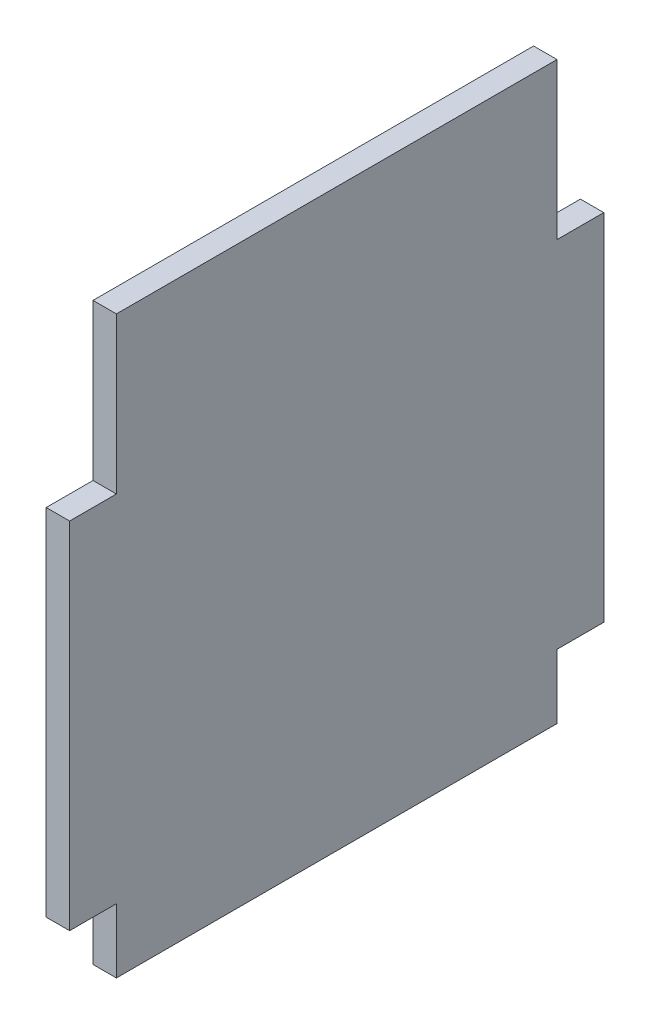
from build123d import *

# Parameters (mm, degrees)
ESQUISSE1_W               = 137
ESQUISSE1_H               = 171
BOSS_EXTRU_1_DEPTH        = 6
ESQUISSE2_W               = 12
ESQUISSE2_H               = 40
ENL_V_MAT_EXTRU_1_DEPTH   = 6
SYM_TRIE2_COPY_1_SKETCH_W = 12
SYM_TRIE2_COPY_1_SKETCH_H = 40
SYM_TRIE2_COPY_1_DEPTH    = 6
ESQUISSE3_W               = 113
ESQUISSE3_H               = 23.5
ENL_V_MAT_EXTRU_2_DEPTH   = 10


with BuildPart() as part:
    # Esquisse1 → Boss.-Extru.1 (new body)
    with BuildSketch(Plane(origin=(0, 0, 0), x_dir=(0, 0, -1), z_dir=(1, 0, 0))):
        Rectangle(ESQUISSE1_W, ESQUISSE1_H)
    extrude(amount=BOSS_EXTRU_1_DEPTH)

    # Esquisse2 → Enl_v. mat.-Extru.1 (cut)
    with BuildSketch(Plane(origin=(6, 0, 0), x_dir=(0, 0, -1), z_dir=(1, 0, 0))):
        with Locations((-62.5, 65.5)):
            Rectangle(ESQUISSE2_W, ESQUISSE2_H)
    enl_v_mat_extru_1 = extrude(amount=-ENL_V_MAT_EXTRU_1_DEPTH, mode=Mode.SUBTRACT)

    # Sym_trie1: Enl_v. mat.-Extru.1 across plane
    add(enl_v_mat_extru_1.mirror(Plane.ZX), mode=Mode.SUBTRACT)

    # Sym_trie2: Enl_v. mat.-Extru.1 across plane
    add(enl_v_mat_extru_1.mirror(Plane.XY), mode=Mode.SUBTRACT)

    # Sym_trie2 copy 1 sketch → Sym_trie2 copy 1 (cut)
    with BuildSketch(Plane(origin=(6, 0, 0), x_dir=(0, 0, 1), z_dir=(1, 0, 0))):
        with Locations((-62.5, 65.5)):
            Rectangle(SYM_TRIE2_COPY_1_SKETCH_W, SYM_TRIE2_COPY_1_SKETCH_H)
    extrude(amount=-SYM_TRIE2_COPY_1_DEPTH, mode=Mode.SUBTRACT)

    # Esquisse3 → Enl_v. mat.-Extru.2 (cut)
    with BuildSketch(Plane(origin=(6, 0, 0), x_dir=(0, 0, -1), z_dir=(1, 0, 0))):
        with Locations((0, -73.75)):
            Rectangle(ESQUISSE3_W, ESQUISSE3_H)
    extrude(amount=-ENL_V_MAT_EXTRU_2_DEPTH, mode=Mode.SUBTRACT)


solid = part.part
